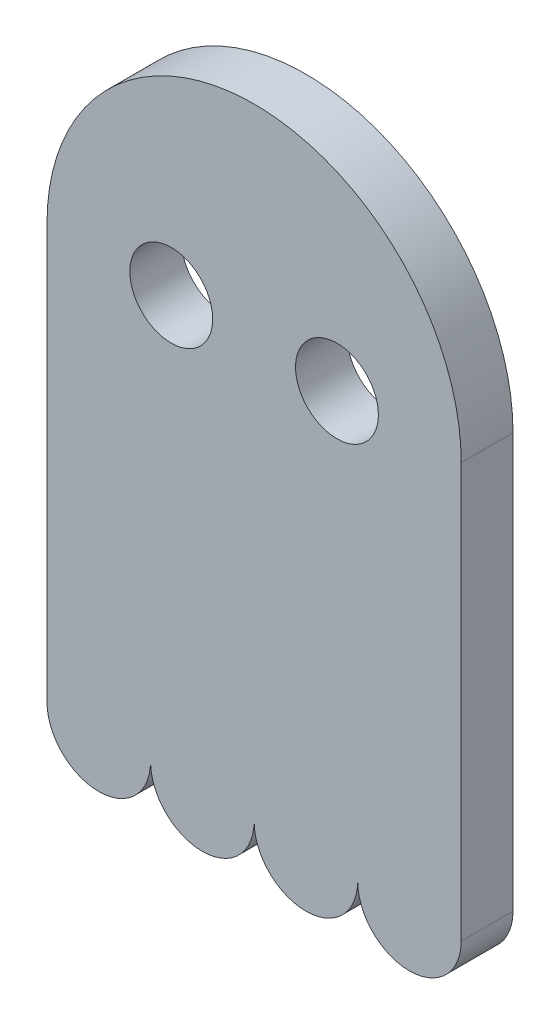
from build123d import *

# Parameters (mm, degrees)
SKETCH1_R      = 4
EXTRUDE1_DEPTH = 5


with BuildPart() as part:
    # Sketch1 → Extrude1 (new body)
    with BuildSketch(Plane.XY):
        with BuildLine():
            Line((20, 0), (20, 40))
            ThreePointArc((20, 40), (0, 60), (-20, 40))
            Line((-20, 40), (-20, 0))
            ThreePointArc((-20, 0), (-15, -5), (-10, 0))
            ThreePointArc((-10, 0), (-5, -5), (0, 0))
            ThreePointArc((0, 0), (5, -5), (10, 0))
            ThreePointArc((10, 0), (15, -5), (20, 0))
        make_face()
        with Locations((8, 40)):
            Circle(SKETCH1_R, mode=Mode.SUBTRACT)
        with Locations(Location((-8, 40, 0), (0, 0, 180))):
            Circle(SKETCH1_R, mode=Mode.SUBTRACT)
    extrude(amount=EXTRUDE1_DEPTH)


solid = part.part
